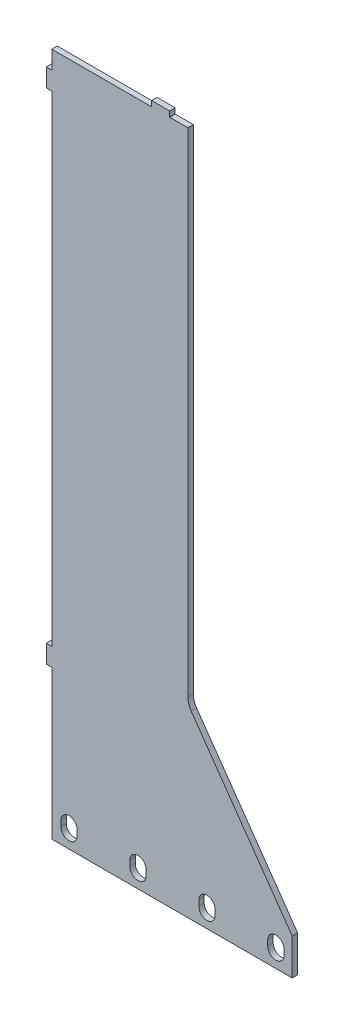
ISO-10303-21;
HEADER;
FILE_DESCRIPTION(('STEP AP214'),'2;1');
FILE_NAME('part.step','',(''),(''),'','','');
FILE_SCHEMA(('AUTOMOTIVE_DESIGN { 1 0 10303 214 1 1 1 1 }'));
ENDSEC;
DATA;
#1=APPLICATION_CONTEXT('core data for automotive mechanical design processes');
#2=APPLICATION_PROTOCOL_DEFINITION('international standard','automotive_design',2000,#1);
#3=PRODUCT_CONTEXT('',#1,'mechanical');
#4=PRODUCT('Part','Part','',(#3));
#5=PRODUCT_RELATED_PRODUCT_CATEGORY('part','',(#4));
#6=PRODUCT_DEFINITION_FORMATION('','',#4);
#7=PRODUCT_DEFINITION_CONTEXT('part definition',#1,'design');
#8=PRODUCT_DEFINITION('design','',#6,#7);
#9=PRODUCT_DEFINITION_SHAPE('','',#8);
#10=(LENGTH_UNIT() NAMED_UNIT(*) SI_UNIT(.MILLI.,.METRE.));
#11=(NAMED_UNIT(*) PLANE_ANGLE_UNIT() SI_UNIT($,.RADIAN.));
#12=(NAMED_UNIT(*) SI_UNIT($,.STERADIAN.) SOLID_ANGLE_UNIT());
#13=UNCERTAINTY_MEASURE_WITH_UNIT(LENGTH_MEASURE(1.E-05),#10,'distance_accuracy_value','');
#14=(GEOMETRIC_REPRESENTATION_CONTEXT(3) GLOBAL_UNCERTAINTY_ASSIGNED_CONTEXT((#13)) GLOBAL_UNIT_ASSIGNED_CONTEXT((#10,
#11,#12)) REPRESENTATION_CONTEXT('',''));
#15=CARTESIAN_POINT('',(0.,0.,0.));
#16=DIRECTION('',(0.,0.,1.));
#17=DIRECTION('',(1.,0.,0.));
#18=AXIS2_PLACEMENT_3D('',#15,#16,#17);
#19=CARTESIAN_POINT('',(0.,313.,93.));
#20=DIRECTION('',(0.,1.,0.));
#21=DIRECTION('',(0.,0.,1.));
#22=AXIS2_PLACEMENT_3D('',#19,#20,#21);
#23=PLANE('',#22);
#24=DIRECTION('',(-1.,0.,0.));
#25=VECTOR('',#24,1.);
#26=CARTESIAN_POINT('',(0.,313.,93.));
#27=LINE('',#26,#25);
#28=CARTESIAN_POINT('',(75.,313.,93.));
#29=VERTEX_POINT('',#28);
#30=CARTESIAN_POINT('',(65.,313.,92.9999999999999));
#31=VERTEX_POINT('',#30);
#32=EDGE_CURVE('E269',#29,#31,#27,.T.);
#33=ORIENTED_EDGE('',*,*,#32,.T.);
#34=DIRECTION('',(0.,0.,1.));
#35=VECTOR('',#34,1.);
#36=CARTESIAN_POINT('',(65.,313.,82.5596934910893));
#37=LINE('',#36,#35);
#38=CARTESIAN_POINT('',(65.,313.,96.));
#39=VERTEX_POINT('',#38);
#40=EDGE_CURVE('E274',#31,#39,#37,.T.);
#41=ORIENTED_EDGE('',*,*,#40,.T.);
#42=DIRECTION('',(-1.,0.,0.));
#43=VECTOR('',#42,1.);
#44=CARTESIAN_POINT('',(0.,313.,96.));
#45=LINE('',#44,#43);
#46=CARTESIAN_POINT('',(75.,313.,96.));
#47=VERTEX_POINT('',#46);
#48=EDGE_CURVE('E316',#47,#39,#45,.T.);
#49=ORIENTED_EDGE('',*,*,#48,.F.);
#50=DIRECTION('',(0.,0.,1.));
#51=VECTOR('',#50,1.);
#52=CARTESIAN_POINT('',(75.,313.,92.9999999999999));
#53=LINE('',#52,#51);
#54=EDGE_CURVE('E283',#29,#47,#53,.T.);
#55=ORIENTED_EDGE('',*,*,#54,.F.);
#56=EDGE_LOOP('',(#33,#41,#49,#55));
#57=FACE_BOUND('',#56,.T.);
#58=ADVANCED_FACE('F37',(#57),#23,.T.);
#59=CARTESIAN_POINT('',(132.5,0.,3.));
#60=DIRECTION('',(-1.,0.,0.));
#61=DIRECTION('',(0.,0.,1.));
#62=AXIS2_PLACEMENT_3D('',#59,#60,#61);
#63=PLANE('',#62);
#64=DIRECTION('',(0.,1.,0.));
#65=VECTOR('',#64,1.);
#66=CARTESIAN_POINT('',(132.5,0.,93.));
#67=LINE('',#66,#65);
#68=CARTESIAN_POINT('',(132.5,-64.,93.));
#69=VERTEX_POINT('',#68);
#70=CARTESIAN_POINT('',(132.5,-44.,92.9999999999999));
#71=VERTEX_POINT('',#70);
#72=EDGE_CURVE('E462',#69,#71,#67,.T.);
#73=ORIENTED_EDGE('',*,*,#72,.T.);
#74=DIRECTION('',(0.,0.,1.));
#75=VECTOR('',#74,1.);
#76=CARTESIAN_POINT('',(132.5,-44.,92.9999999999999));
#77=LINE('',#76,#75);
#78=CARTESIAN_POINT('',(132.5,-44.,96.));
#79=VERTEX_POINT('',#78);
#80=EDGE_CURVE('E292',#71,#79,#77,.T.);
#81=ORIENTED_EDGE('',*,*,#80,.T.);
#82=DIRECTION('',(0.,-1.,0.));
#83=VECTOR('',#82,1.);
#84=CARTESIAN_POINT('',(132.5,0.,96.));
#85=LINE('',#84,#83);
#86=CARTESIAN_POINT('',(132.5,-64.,96.));
#87=VERTEX_POINT('',#86);
#88=EDGE_CURVE('E478',#79,#87,#85,.T.);
#89=ORIENTED_EDGE('',*,*,#88,.T.);
#90=DIRECTION('',(0.,0.,-1.));
#91=VECTOR('',#90,1.);
#92=CARTESIAN_POINT('',(132.5,-64.,93.));
#93=LINE('',#92,#91);
#94=EDGE_CURVE('E465',#87,#69,#93,.T.);
#95=ORIENTED_EDGE('',*,*,#94,.T.);
#96=EDGE_LOOP('',(#73,#81,#89,#95));
#97=FACE_BOUND('',#96,.T.);
#98=ADVANCED_FACE('F578',(#97),#63,.F.);
#99=CARTESIAN_POINT('',(0.,0.,3.));
#100=DIRECTION('',(1.,0.,0.));
#101=DIRECTION('',(0.,0.,-1.));
#102=AXIS2_PLACEMENT_3D('',#99,#100,#101);
#103=PLANE('',#102);
#104=DIRECTION('',(0.,0.,1.));
#105=VECTOR('',#104,1.);
#106=CARTESIAN_POINT('',(0.,18.,93.));
#107=LINE('',#106,#105);
#108=CARTESIAN_POINT('',(0.,18.,93.));
#109=VERTEX_POINT('',#108);
#110=CARTESIAN_POINT('',(0.,18.,96.));
#111=VERTEX_POINT('',#110);
#112=EDGE_CURVE('E342',#109,#111,#107,.T.);
#113=ORIENTED_EDGE('',*,*,#112,.F.);
#114=DIRECTION('',(0.,-1.,0.));
#115=VECTOR('',#114,1.);
#116=CARTESIAN_POINT('',(0.,0.,93.));
#117=LINE('',#116,#115);
#118=CARTESIAN_POINT('',(0.,-64.,93.));
#119=VERTEX_POINT('',#118);
#120=EDGE_CURVE('E461',#109,#119,#117,.T.);
#121=ORIENTED_EDGE('',*,*,#120,.T.);
#122=DIRECTION('',(0.,0.,1.));
#123=VECTOR('',#122,1.);
#124=CARTESIAN_POINT('',(0.,-64.,93.));
#125=LINE('',#124,#123);
#126=CARTESIAN_POINT('',(0.,-64.,96.));
#127=VERTEX_POINT('',#126);
#128=EDGE_CURVE('E468',#119,#127,#125,.T.);
#129=ORIENTED_EDGE('',*,*,#128,.T.);
#130=DIRECTION('',(0.,1.,0.));
#131=VECTOR('',#130,1.);
#132=CARTESIAN_POINT('',(0.,0.,96.));
#133=LINE('',#132,#131);
#134=EDGE_CURVE('E477',#127,#111,#133,.T.);
#135=ORIENTED_EDGE('',*,*,#134,.T.);
#136=EDGE_LOOP('',(#113,#121,#129,#135));
#137=FACE_BOUND('',#136,.T.);
#138=ADVANCED_FACE('F576',(#137),#103,.F.);
#139=CARTESIAN_POINT('',(225.548374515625,0.,96.));
#140=DIRECTION('',(0.,0.,1.));
#141=DIRECTION('',(1.,0.,0.));
#142=AXIS2_PLACEMENT_3D('',#139,#140,#141);
#143=PLANE('',#142);
#144=DIRECTION('',(0.,-1.,0.));
#145=VECTOR('',#144,1.);
#146=CARTESIAN_POINT('',(75.,313.,96.));
#147=LINE('',#146,#145);
#148=CARTESIAN_POINT('',(75.,41.2714982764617,96.));
#149=VERTEX_POINT('',#148);
#150=EDGE_CURVE('E505',#47,#149,#147,.T.);
#151=ORIENTED_EDGE('',*,*,#150,.F.);
#152=ORIENTED_EDGE('',*,*,#48,.T.);
#153=DIRECTION('',(0.,1.,0.));
#154=VECTOR('',#153,1.);
#155=CARTESIAN_POINT('',(65.,313.,96.));
#156=LINE('',#155,#154);
#157=CARTESIAN_POINT('',(65.,316.,96.));
#158=VERTEX_POINT('',#157);
#159=EDGE_CURVE('E52',#39,#158,#156,.T.);
#160=ORIENTED_EDGE('',*,*,#159,.T.);
#161=DIRECTION('',(-1.,0.,0.));
#162=VECTOR('',#161,1.);
#163=CARTESIAN_POINT('',(55.,316.,96.));
#164=LINE('',#163,#162);
#165=CARTESIAN_POINT('',(55.,316.,96.));
#166=VERTEX_POINT('',#165);
#167=EDGE_CURVE('E280',#158,#166,#164,.T.);
#168=ORIENTED_EDGE('',*,*,#167,.T.);
#169=DIRECTION('',(0.,-1.,0.));
#170=VECTOR('',#169,1.);
#171=CARTESIAN_POINT('',(55.,313.,96.));
#172=LINE('',#171,#170);
#173=CARTESIAN_POINT('',(55.,313.,96.));
#174=VERTEX_POINT('',#173);
#175=EDGE_CURVE('E531',#166,#174,#172,.T.);
#176=ORIENTED_EDGE('',*,*,#175,.T.);
#177=CARTESIAN_POINT('',(0.,313.,96.));
#178=VERTEX_POINT('',#177);
#179=EDGE_CURVE('E319',#174,#178,#45,.T.);
#180=ORIENTED_EDGE('',*,*,#179,.T.);
#181=DIRECTION('',(0.,-1.,0.));
#182=VECTOR('',#181,1.);
#183=CARTESIAN_POINT('',(0.,303.,96.));
#184=LINE('',#183,#182);
#185=CARTESIAN_POINT('',(0.,303.,96.));
#186=VERTEX_POINT('',#185);
#187=EDGE_CURVE('E318',#178,#186,#184,.T.);
#188=ORIENTED_EDGE('',*,*,#187,.T.);
#189=DIRECTION('',(-1.,0.,0.));
#190=VECTOR('',#189,1.);
#191=CARTESIAN_POINT('',(0.,303.,96.));
#192=LINE('',#191,#190);
#193=CARTESIAN_POINT('',(-3.,303.,96.));
#194=VERTEX_POINT('',#193);
#195=EDGE_CURVE('E322',#186,#194,#192,.T.);
#196=ORIENTED_EDGE('',*,*,#195,.T.);
#197=DIRECTION('',(0.,-1.,0.));
#198=VECTOR('',#197,1.);
#199=CARTESIAN_POINT('',(-3.,303.,96.));
#200=LINE('',#199,#198);
#201=CARTESIAN_POINT('',(-3.,293.,96.));
#202=VERTEX_POINT('',#201);
#203=EDGE_CURVE('E325',#194,#202,#200,.T.);
#204=ORIENTED_EDGE('',*,*,#203,.T.);
#205=DIRECTION('',(1.,0.,0.));
#206=VECTOR('',#205,1.);
#207=CARTESIAN_POINT('',(-3.,293.,96.));
#208=LINE('',#207,#206);
#209=CARTESIAN_POINT('',(0.,293.,96.));
#210=VERTEX_POINT('',#209);
#211=EDGE_CURVE('E328',#202,#210,#208,.T.);
#212=ORIENTED_EDGE('',*,*,#211,.T.);
#213=DIRECTION('',(0.,-1.,0.));
#214=VECTOR('',#213,1.);
#215=CARTESIAN_POINT('',(0.,28.,96.));
#216=LINE('',#215,#214);
#217=CARTESIAN_POINT('',(0.,28.,96.));
#218=VERTEX_POINT('',#217);
#219=EDGE_CURVE('E331',#210,#218,#216,.T.);
#220=ORIENTED_EDGE('',*,*,#219,.T.);
#221=DIRECTION('',(-1.,0.,0.));
#222=VECTOR('',#221,1.);
#223=CARTESIAN_POINT('',(0.,28.,96.));
#224=LINE('',#223,#222);
#225=CARTESIAN_POINT('',(-3.00000000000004,28.,96.));
#226=VERTEX_POINT('',#225);
#227=EDGE_CURVE('E334',#218,#226,#224,.T.);
#228=ORIENTED_EDGE('',*,*,#227,.T.);
#229=DIRECTION('',(0.,-1.,0.));
#230=VECTOR('',#229,1.);
#231=CARTESIAN_POINT('',(-3.00000000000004,28.,96.));
#232=LINE('',#231,#230);
#233=CARTESIAN_POINT('',(-3.00000000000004,18.,96.));
#234=VERTEX_POINT('',#233);
#235=EDGE_CURVE('E337',#226,#234,#232,.T.);
#236=ORIENTED_EDGE('',*,*,#235,.T.);
#237=DIRECTION('',(1.,0.,0.));
#238=VECTOR('',#237,1.);
#239=CARTESIAN_POINT('',(-3.00000000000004,18.,96.));
#240=LINE('',#239,#238);
#241=EDGE_CURVE('E290',#234,#111,#240,.T.);
#242=ORIENTED_EDGE('',*,*,#241,.T.);
#243=ORIENTED_EDGE('',*,*,#134,.F.);
#244=DIRECTION('',(-1.,0.,0.));
#245=VECTOR('',#244,1.);
#246=CARTESIAN_POINT('',(196.570273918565,-64.,96.));
#247=LINE('',#246,#245);
#248=EDGE_CURVE('E466',#87,#127,#247,.T.);
#249=ORIENTED_EDGE('',*,*,#248,.F.);
#250=ORIENTED_EDGE('',*,*,#88,.F.);
#251=DIRECTION('',(0.573576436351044,-0.819152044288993,0.));
#252=VECTOR('',#251,1.);
#253=CARTESIAN_POINT('',(75.,38.1185103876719,96.));
#254=LINE('',#253,#252);
#255=CARTESIAN_POINT('',(76.8084795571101,35.5357339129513,96.));
#256=VERTEX_POINT('',#255);
#257=EDGE_CURVE('E507',#256,#79,#254,.T.);
#258=ORIENTED_EDGE('',*,*,#257,.F.);
#259=CARTESIAN_POINT('',(85.,41.2714982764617,96.));
#260=DIRECTION('',(0.,0.,1.));
#261=DIRECTION('',(1.,0.,0.));
#262=AXIS2_PLACEMENT_3D('',#259,#260,#261);
#263=CIRCLE('',#262,10.);
#264=EDGE_CURVE('E45',#256,#149,#263,.F.);
#265=ORIENTED_EDGE('',*,*,#264,.T.);
#266=EDGE_LOOP('',(#151,#152,#160,#168,#176,#180,#188,#196,#204,#212,#220,#228,#236,#242,#243,
#249,#250,#258,#265));
#267=FACE_BOUND('',#266,.T.);
#268=CARTESIAN_POINT('',(85.5,-52.5,96.));
#269=DIRECTION('',(0.,0.,1.));
#270=DIRECTION('',(1.,0.,0.));
#271=AXIS2_PLACEMENT_3D('',#268,#269,#270);
#272=CIRCLE('',#271,4.5);
#273=CARTESIAN_POINT('',(90.,-52.5,96.));
#274=VERTEX_POINT('',#273);
#275=CARTESIAN_POINT('',(81.,-52.5,96.));
#276=VERTEX_POINT('',#275);
#277=EDGE_CURVE('E362',#274,#276,#272,.T.);
#278=ORIENTED_EDGE('',*,*,#277,.F.);
#279=DIRECTION('',(0.,1.,0.));
#280=VECTOR('',#279,1.);
#281=CARTESIAN_POINT('',(90.,-52.5,96.));
#282=LINE('',#281,#280);
#283=CARTESIAN_POINT('',(90.,-55.5,96.));
#284=VERTEX_POINT('',#283);
#285=EDGE_CURVE('E372',#284,#274,#282,.T.);
#286=ORIENTED_EDGE('',*,*,#285,.F.);
#287=CARTESIAN_POINT('',(85.5,-55.5,96.));
#288=DIRECTION('',(0.,0.,1.));
#289=DIRECTION('',(1.,0.,0.));
#290=AXIS2_PLACEMENT_3D('',#287,#288,#289);
#291=CIRCLE('',#290,4.5);
#292=CARTESIAN_POINT('',(81.,-55.5,96.));
#293=VERTEX_POINT('',#292);
#294=EDGE_CURVE('E369',#293,#284,#291,.T.);
#295=ORIENTED_EDGE('',*,*,#294,.F.);
#296=DIRECTION('',(0.,-1.,0.));
#297=VECTOR('',#296,1.);
#298=CARTESIAN_POINT('',(81.,-52.5,96.));
#299=LINE('',#298,#297);
#300=EDGE_CURVE('E365',#276,#293,#299,.T.);
#301=ORIENTED_EDGE('',*,*,#300,.F.);
#302=EDGE_LOOP('',(#278,#286,#295,#301));
#303=FACE_BOUND('',#302,.T.);
#304=CARTESIAN_POINT('',(123.5,-52.5,96.));
#305=DIRECTION('',(0.,0.,1.));
#306=DIRECTION('',(1.,0.,0.));
#307=AXIS2_PLACEMENT_3D('',#304,#305,#306);
#308=CIRCLE('',#307,4.5);
#309=CARTESIAN_POINT('',(128.,-52.5,96.));
#310=VERTEX_POINT('',#309);
#311=CARTESIAN_POINT('',(119.,-52.5,96.));
#312=VERTEX_POINT('',#311);
#313=EDGE_CURVE('E345',#310,#312,#308,.T.);
#314=ORIENTED_EDGE('',*,*,#313,.F.);
#315=DIRECTION('',(0.,1.,0.));
#316=VECTOR('',#315,1.);
#317=CARTESIAN_POINT('',(128.,-52.5,96.));
#318=LINE('',#317,#316);
#319=CARTESIAN_POINT('',(128.,-55.5,96.));
#320=VERTEX_POINT('',#319);
#321=EDGE_CURVE('E393',#320,#310,#318,.T.);
#322=ORIENTED_EDGE('',*,*,#321,.F.);
#323=CARTESIAN_POINT('',(123.5,-55.5,96.));
#324=DIRECTION('',(0.,0.,1.));
#325=DIRECTION('',(1.,0.,0.));
#326=AXIS2_PLACEMENT_3D('',#323,#324,#325);
#327=CIRCLE('',#326,4.5);
#328=CARTESIAN_POINT('',(119.,-55.5,96.));
#329=VERTEX_POINT('',#328);
#330=EDGE_CURVE('E390',#329,#320,#327,.T.);
#331=ORIENTED_EDGE('',*,*,#330,.F.);
#332=DIRECTION('',(0.,-1.,0.));
#333=VECTOR('',#332,1.);
#334=CARTESIAN_POINT('',(119.,-52.5,96.));
#335=LINE('',#334,#333);
#336=EDGE_CURVE('E387',#312,#329,#335,.T.);
#337=ORIENTED_EDGE('',*,*,#336,.F.);
#338=EDGE_LOOP('',(#314,#322,#331,#337));
#339=FACE_BOUND('',#338,.T.);
#340=CARTESIAN_POINT('',(47.5,-52.5,96.));
#341=DIRECTION('',(0.,0.,1.));
#342=DIRECTION('',(1.,0.,0.));
#343=AXIS2_PLACEMENT_3D('',#340,#341,#342);
#344=CIRCLE('',#343,4.5);
#345=CARTESIAN_POINT('',(52.,-52.5,96.));
#346=VERTEX_POINT('',#345);
#347=CARTESIAN_POINT('',(43.,-52.5,96.));
#348=VERTEX_POINT('',#347);
#349=EDGE_CURVE('E411',#346,#348,#344,.T.);
#350=ORIENTED_EDGE('',*,*,#349,.F.);
#351=DIRECTION('',(0.,1.,0.));
#352=VECTOR('',#351,1.);
#353=CARTESIAN_POINT('',(52.,-52.5,96.));
#354=LINE('',#353,#352);
#355=CARTESIAN_POINT('',(52.,-55.5,96.));
#356=VERTEX_POINT('',#355);
#357=EDGE_CURVE('E420',#356,#346,#354,.T.);
#358=ORIENTED_EDGE('',*,*,#357,.F.);
#359=CARTESIAN_POINT('',(47.5,-55.5,96.));
#360=DIRECTION('',(0.,0.,1.));
#361=DIRECTION('',(1.,0.,0.));
#362=AXIS2_PLACEMENT_3D('',#359,#360,#361);
#363=CIRCLE('',#362,4.5);
#364=CARTESIAN_POINT('',(43.,-55.5,96.));
#365=VERTEX_POINT('',#364);
#366=EDGE_CURVE('E417',#365,#356,#363,.T.);
#367=ORIENTED_EDGE('',*,*,#366,.F.);
#368=DIRECTION('',(0.,-1.,0.));
#369=VECTOR('',#368,1.);
#370=CARTESIAN_POINT('',(43.,-52.5,96.));
#371=LINE('',#370,#369);
#372=EDGE_CURVE('E414',#348,#365,#371,.T.);
#373=ORIENTED_EDGE('',*,*,#372,.F.);
#374=EDGE_LOOP('',(#350,#358,#367,#373));
#375=FACE_BOUND('',#374,.T.);
#376=CARTESIAN_POINT('',(9.50000000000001,-52.5,96.));
#377=DIRECTION('',(0.,0.,1.));
#378=DIRECTION('',(1.,0.,0.));
#379=AXIS2_PLACEMENT_3D('',#376,#377,#378);
#380=CIRCLE('',#379,4.5);
#381=CARTESIAN_POINT('',(14.,-52.5,96.));
#382=VERTEX_POINT('',#381);
#383=CARTESIAN_POINT('',(5.,-52.5,96.));
#384=VERTEX_POINT('',#383);
#385=EDGE_CURVE('E436',#382,#384,#380,.T.);
#386=ORIENTED_EDGE('',*,*,#385,.F.);
#387=DIRECTION('',(0.,1.,0.));
#388=VECTOR('',#387,1.);
#389=CARTESIAN_POINT('',(14.,-52.5,96.));
#390=LINE('',#389,#388);
#391=CARTESIAN_POINT('',(14.,-55.5,96.));
#392=VERTEX_POINT('',#391);
#393=EDGE_CURVE('E445',#392,#382,#390,.T.);
#394=ORIENTED_EDGE('',*,*,#393,.F.);
#395=CARTESIAN_POINT('',(9.50000000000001,-55.5,96.));
#396=DIRECTION('',(0.,0.,1.));
#397=DIRECTION('',(1.,0.,0.));
#398=AXIS2_PLACEMENT_3D('',#395,#396,#397);
#399=CIRCLE('',#398,4.5);
#400=CARTESIAN_POINT('',(5.,-55.5,96.));
#401=VERTEX_POINT('',#400);
#402=EDGE_CURVE('E442',#401,#392,#399,.T.);
#403=ORIENTED_EDGE('',*,*,#402,.F.);
#404=DIRECTION('',(0.,-1.,0.));
#405=VECTOR('',#404,1.);
#406=CARTESIAN_POINT('',(5.,-52.5,96.));
#407=LINE('',#406,#405);
#408=EDGE_CURVE('E439',#384,#401,#407,.T.);
#409=ORIENTED_EDGE('',*,*,#408,.F.);
#410=EDGE_LOOP('',(#386,#394,#403,#409));
#411=FACE_BOUND('',#410,.T.);
#412=ADVANCED_FACE('F503',(#267,#303,#339,#375,#411),#143,.T.);
#413=CARTESIAN_POINT('',(196.570273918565,0.,93.));
#414=DIRECTION('',(0.,0.,-1.));
#415=DIRECTION('',(0.,1.,0.));
#416=AXIS2_PLACEMENT_3D('',#413,#414,#415);
#417=PLANE('',#416);
#418=DIRECTION('',(0.,-1.,0.));
#419=VECTOR('',#418,1.);
#420=CARTESIAN_POINT('',(75.,313.,92.9999999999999));
#421=LINE('',#420,#419);
#422=CARTESIAN_POINT('',(75.,41.2714982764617,92.9999999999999));
#423=VERTEX_POINT('',#422);
#424=EDGE_CURVE('E518',#29,#423,#421,.T.);
#425=ORIENTED_EDGE('',*,*,#424,.T.);
#426=CARTESIAN_POINT('',(85.,41.2714982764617,93.));
#427=DIRECTION('',(0.,0.,-1.));
#428=DIRECTION('',(0.,1.,0.));
#429=AXIS2_PLACEMENT_3D('',#426,#427,#428);
#430=CIRCLE('',#429,10.);
#431=CARTESIAN_POINT('',(76.8084795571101,35.5357339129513,92.9999999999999));
#432=VERTEX_POINT('',#431);
#433=EDGE_CURVE('E11',#423,#432,#430,.F.);
#434=ORIENTED_EDGE('',*,*,#433,.T.);
#435=DIRECTION('',(0.573576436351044,-0.819152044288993,0.));
#436=VECTOR('',#435,1.);
#437=CARTESIAN_POINT('',(75.,38.1185103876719,92.9999999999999));
#438=LINE('',#437,#436);
#439=EDGE_CURVE('E516',#432,#71,#438,.T.);
#440=ORIENTED_EDGE('',*,*,#439,.T.);
#441=ORIENTED_EDGE('',*,*,#72,.F.);
#442=DIRECTION('',(-1.,0.,0.));
#443=VECTOR('',#442,1.);
#444=CARTESIAN_POINT('',(196.570273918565,-64.,93.));
#445=LINE('',#444,#443);
#446=EDGE_CURVE('E471',#69,#119,#445,.T.);
#447=ORIENTED_EDGE('',*,*,#446,.T.);
#448=ORIENTED_EDGE('',*,*,#120,.F.);
#449=DIRECTION('',(1.,0.,0.));
#450=VECTOR('',#449,1.);
#451=CARTESIAN_POINT('',(-3.00000000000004,18.,93.));
#452=LINE('',#451,#450);
#453=CARTESIAN_POINT('',(-3.00000000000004,18.,93.));
#454=VERTEX_POINT('',#453);
#455=EDGE_CURVE('E312',#454,#109,#452,.T.);
#456=ORIENTED_EDGE('',*,*,#455,.F.);
#457=DIRECTION('',(0.,-1.,0.));
#458=VECTOR('',#457,1.);
#459=CARTESIAN_POINT('',(-3.00000000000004,28.,93.));
#460=LINE('',#459,#458);
#461=CARTESIAN_POINT('',(-3.00000000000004,28.,93.));
#462=VERTEX_POINT('',#461);
#463=EDGE_CURVE('E309',#462,#454,#460,.T.);
#464=ORIENTED_EDGE('',*,*,#463,.F.);
#465=DIRECTION('',(-1.,0.,0.));
#466=VECTOR('',#465,1.);
#467=CARTESIAN_POINT('',(0.,28.,93.));
#468=LINE('',#467,#466);
#469=CARTESIAN_POINT('',(0.,28.,93.));
#470=VERTEX_POINT('',#469);
#471=EDGE_CURVE('E306',#470,#462,#468,.T.);
#472=ORIENTED_EDGE('',*,*,#471,.F.);
#473=DIRECTION('',(0.,-1.,0.));
#474=VECTOR('',#473,1.);
#475=CARTESIAN_POINT('',(0.,28.,93.));
#476=LINE('',#475,#474);
#477=CARTESIAN_POINT('',(0.,293.,93.));
#478=VERTEX_POINT('',#477);
#479=EDGE_CURVE('E303',#478,#470,#476,.T.);
#480=ORIENTED_EDGE('',*,*,#479,.F.);
#481=DIRECTION('',(1.,0.,0.));
#482=VECTOR('',#481,1.);
#483=CARTESIAN_POINT('',(-3.,293.,93.));
#484=LINE('',#483,#482);
#485=CARTESIAN_POINT('',(-3.,293.,93.));
#486=VERTEX_POINT('',#485);
#487=EDGE_CURVE('E300',#486,#478,#484,.T.);
#488=ORIENTED_EDGE('',*,*,#487,.F.);
#489=DIRECTION('',(0.,-1.,0.));
#490=VECTOR('',#489,1.);
#491=CARTESIAN_POINT('',(-3.,303.,93.));
#492=LINE('',#491,#490);
#493=CARTESIAN_POINT('',(-3.,303.,93.));
#494=VERTEX_POINT('',#493);
#495=EDGE_CURVE('E297',#494,#486,#492,.T.);
#496=ORIENTED_EDGE('',*,*,#495,.F.);
#497=DIRECTION('',(-1.,0.,0.));
#498=VECTOR('',#497,1.);
#499=CARTESIAN_POINT('',(0.,303.,93.));
#500=LINE('',#499,#498);
#501=CARTESIAN_POINT('',(0.,303.,93.));
#502=VERTEX_POINT('',#501);
#503=EDGE_CURVE('E288',#502,#494,#500,.T.);
#504=ORIENTED_EDGE('',*,*,#503,.F.);
#505=DIRECTION('',(0.,-1.,0.));
#506=VECTOR('',#505,1.);
#507=CARTESIAN_POINT('',(0.,303.,93.));
#508=LINE('',#507,#506);
#509=CARTESIAN_POINT('',(0.,313.,93.));
#510=VERTEX_POINT('',#509);
#511=EDGE_CURVE('E284',#510,#502,#508,.T.);
#512=ORIENTED_EDGE('',*,*,#511,.F.);
#513=CARTESIAN_POINT('',(55.,313.,92.9999999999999));
#514=VERTEX_POINT('',#513);
#515=EDGE_CURVE('E285',#514,#510,#27,.T.);
#516=ORIENTED_EDGE('',*,*,#515,.F.);
#517=DIRECTION('',(0.,-1.,0.));
#518=VECTOR('',#517,1.);
#519=CARTESIAN_POINT('',(55.,313.,92.9999999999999));
#520=LINE('',#519,#518);
#521=CARTESIAN_POINT('',(55.,316.,92.9999999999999));
#522=VERTEX_POINT('',#521);
#523=EDGE_CURVE('E691',#522,#514,#520,.T.);
#524=ORIENTED_EDGE('',*,*,#523,.F.);
#525=DIRECTION('',(-1.,0.,0.));
#526=VECTOR('',#525,1.);
#527=CARTESIAN_POINT('',(55.,316.,92.9999999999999));
#528=LINE('',#527,#526);
#529=CARTESIAN_POINT('',(65.,316.,92.9999999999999));
#530=VERTEX_POINT('',#529);
#531=EDGE_CURVE('E271',#530,#522,#528,.T.);
#532=ORIENTED_EDGE('',*,*,#531,.F.);
#533=DIRECTION('',(0.,1.,0.));
#534=VECTOR('',#533,1.);
#535=CARTESIAN_POINT('',(65.,313.,92.9999999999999));
#536=LINE('',#535,#534);
#537=EDGE_CURVE('E265',#31,#530,#536,.T.);
#538=ORIENTED_EDGE('',*,*,#537,.F.);
#539=ORIENTED_EDGE('',*,*,#32,.F.);
#540=EDGE_LOOP('',(#425,#434,#440,#441,#447,#448,#456,#464,#472,#480,#488,#496,#504,#512,#516,
#524,#532,#538,#539));
#541=FACE_BOUND('',#540,.T.);
#542=CARTESIAN_POINT('',(85.5,-52.5,93.));
#543=DIRECTION('',(0.,0.,-1.));
#544=DIRECTION('',(0.,1.,0.));
#545=AXIS2_PLACEMENT_3D('',#542,#543,#544);
#546=CIRCLE('',#545,4.5);
#547=CARTESIAN_POINT('',(81.,-52.5,93.));
#548=VERTEX_POINT('',#547);
#549=CARTESIAN_POINT('',(90.,-52.5,93.));
#550=VERTEX_POINT('',#549);
#551=EDGE_CURVE('E495',#548,#550,#546,.T.);
#552=ORIENTED_EDGE('',*,*,#551,.F.);
#553=DIRECTION('',(0.,1.,0.));
#554=VECTOR('',#553,1.);
#555=CARTESIAN_POINT('',(81.,0.,93.));
#556=LINE('',#555,#554);
#557=CARTESIAN_POINT('',(81.,-55.5,93.));
#558=VERTEX_POINT('',#557);
#559=EDGE_CURVE('E407',#558,#548,#556,.T.);
#560=ORIENTED_EDGE('',*,*,#559,.F.);
#561=CARTESIAN_POINT('',(85.5,-55.5,93.));
#562=DIRECTION('',(0.,0.,-1.));
#563=DIRECTION('',(0.,1.,0.));
#564=AXIS2_PLACEMENT_3D('',#561,#562,#563);
#565=CIRCLE('',#564,4.5);
#566=CARTESIAN_POINT('',(90.,-55.5,93.));
#567=VERTEX_POINT('',#566);
#568=EDGE_CURVE('E493',#567,#558,#565,.T.);
#569=ORIENTED_EDGE('',*,*,#568,.F.);
#570=DIRECTION('',(0.,-1.,0.));
#571=VECTOR('',#570,1.);
#572=CARTESIAN_POINT('',(90.,0.,93.));
#573=LINE('',#572,#571);
#574=EDGE_CURVE('E409',#550,#567,#573,.T.);
#575=ORIENTED_EDGE('',*,*,#574,.F.);
#576=EDGE_LOOP('',(#552,#560,#569,#575));
#577=FACE_BOUND('',#576,.T.);
#578=CARTESIAN_POINT('',(123.5,-52.5,93.));
#579=DIRECTION('',(0.,0.,-1.));
#580=DIRECTION('',(0.,1.,0.));
#581=AXIS2_PLACEMENT_3D('',#578,#579,#580);
#582=CIRCLE('',#581,4.5);
#583=CARTESIAN_POINT('',(119.,-52.5,93.));
#584=VERTEX_POINT('',#583);
#585=CARTESIAN_POINT('',(128.,-52.5,93.));
#586=VERTEX_POINT('',#585);
#587=EDGE_CURVE('E491',#584,#586,#582,.T.);
#588=ORIENTED_EDGE('',*,*,#587,.F.);
#589=DIRECTION('',(0.,1.,0.));
#590=VECTOR('',#589,1.);
#591=CARTESIAN_POINT('',(119.,0.,93.));
#592=LINE('',#591,#590);
#593=CARTESIAN_POINT('',(119.,-55.5,93.));
#594=VERTEX_POINT('',#593);
#595=EDGE_CURVE('E378',#594,#584,#592,.T.);
#596=ORIENTED_EDGE('',*,*,#595,.F.);
#597=CARTESIAN_POINT('',(123.5,-55.5,93.));
#598=DIRECTION('',(0.,0.,-1.));
#599=DIRECTION('',(0.,1.,0.));
#600=AXIS2_PLACEMENT_3D('',#597,#598,#599);
#601=CIRCLE('',#600,4.5);
#602=CARTESIAN_POINT('',(128.,-55.5,93.));
#603=VERTEX_POINT('',#602);
#604=EDGE_CURVE('E489',#603,#594,#601,.T.);
#605=ORIENTED_EDGE('',*,*,#604,.F.);
#606=DIRECTION('',(0.,-1.,0.));
#607=VECTOR('',#606,1.);
#608=CARTESIAN_POINT('',(128.,0.,93.));
#609=LINE('',#608,#607);
#610=EDGE_CURVE('E405',#586,#603,#609,.T.);
#611=ORIENTED_EDGE('',*,*,#610,.F.);
#612=EDGE_LOOP('',(#588,#596,#605,#611));
#613=FACE_BOUND('',#612,.T.);
#614=CARTESIAN_POINT('',(47.5,-52.5,93.));
#615=DIRECTION('',(0.,0.,-1.));
#616=DIRECTION('',(0.,1.,0.));
#617=AXIS2_PLACEMENT_3D('',#614,#615,#616);
#618=CIRCLE('',#617,4.5);
#619=CARTESIAN_POINT('',(43.,-52.5,93.));
#620=VERTEX_POINT('',#619);
#621=CARTESIAN_POINT('',(52.,-52.5,93.));
#622=VERTEX_POINT('',#621);
#623=EDGE_CURVE('E487',#620,#622,#618,.T.);
#624=ORIENTED_EDGE('',*,*,#623,.F.);
#625=DIRECTION('',(0.,1.,0.));
#626=VECTOR('',#625,1.);
#627=CARTESIAN_POINT('',(43.,0.,93.));
#628=LINE('',#627,#626);
#629=CARTESIAN_POINT('',(43.,-55.5,93.));
#630=VERTEX_POINT('',#629);
#631=EDGE_CURVE('E426',#630,#620,#628,.T.);
#632=ORIENTED_EDGE('',*,*,#631,.F.);
#633=CARTESIAN_POINT('',(47.5,-55.5,93.));
#634=DIRECTION('',(0.,0.,-1.));
#635=DIRECTION('',(0.,1.,0.));
#636=AXIS2_PLACEMENT_3D('',#633,#634,#635);
#637=CIRCLE('',#636,4.5);
#638=CARTESIAN_POINT('',(52.,-55.5,93.));
#639=VERTEX_POINT('',#638);
#640=EDGE_CURVE('E485',#639,#630,#637,.T.);
#641=ORIENTED_EDGE('',*,*,#640,.F.);
#642=DIRECTION('',(0.,-1.,0.));
#643=VECTOR('',#642,1.);
#644=CARTESIAN_POINT('',(52.,0.,93.));
#645=LINE('',#644,#643);
#646=EDGE_CURVE('E434',#622,#639,#645,.T.);
#647=ORIENTED_EDGE('',*,*,#646,.F.);
#648=EDGE_LOOP('',(#624,#632,#641,#647));
#649=FACE_BOUND('',#648,.T.);
#650=CARTESIAN_POINT('',(9.50000000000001,-52.5,93.));
#651=DIRECTION('',(0.,0.,-1.));
#652=DIRECTION('',(0.,1.,0.));
#653=AXIS2_PLACEMENT_3D('',#650,#651,#652);
#654=CIRCLE('',#653,4.5);
#655=CARTESIAN_POINT('',(5.,-52.5,93.));
#656=VERTEX_POINT('',#655);
#657=CARTESIAN_POINT('',(14.,-52.5,93.));
#658=VERTEX_POINT('',#657);
#659=EDGE_CURVE('E483',#656,#658,#654,.T.);
#660=ORIENTED_EDGE('',*,*,#659,.F.);
#661=DIRECTION('',(0.,1.,0.));
#662=VECTOR('',#661,1.);
#663=CARTESIAN_POINT('',(5.,0.,93.));
#664=LINE('',#663,#662);
#665=CARTESIAN_POINT('',(5.,-55.5,93.));
#666=VERTEX_POINT('',#665);
#667=EDGE_CURVE('E451',#666,#656,#664,.T.);
#668=ORIENTED_EDGE('',*,*,#667,.F.);
#669=CARTESIAN_POINT('',(9.50000000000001,-55.5,93.));
#670=DIRECTION('',(0.,0.,-1.));
#671=DIRECTION('',(0.,1.,0.));
#672=AXIS2_PLACEMENT_3D('',#669,#670,#671);
#673=CIRCLE('',#672,4.5);
#674=CARTESIAN_POINT('',(14.,-55.5,93.));
#675=VERTEX_POINT('',#674);
#676=EDGE_CURVE('E480',#675,#666,#673,.T.);
#677=ORIENTED_EDGE('',*,*,#676,.F.);
#678=DIRECTION('',(0.,-1.,0.));
#679=VECTOR('',#678,1.);
#680=CARTESIAN_POINT('',(14.,0.,93.));
#681=LINE('',#680,#679);
#682=EDGE_CURVE('E459',#658,#675,#681,.T.);
#683=ORIENTED_EDGE('',*,*,#682,.F.);
#684=EDGE_LOOP('',(#660,#668,#677,#683));
#685=FACE_BOUND('',#684,.T.);
#686=ADVANCED_FACE('F266',(#541,#577,#613,#649,#685),#417,.T.);
#687=CARTESIAN_POINT('',(196.570273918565,-64.,93.));
#688=DIRECTION('',(0.,-1.,0.));
#689=DIRECTION('',(0.,0.,-1.));
#690=AXIS2_PLACEMENT_3D('',#687,#688,#689);
#691=PLANE('',#690);
#692=ORIENTED_EDGE('',*,*,#94,.F.);
#693=ORIENTED_EDGE('',*,*,#248,.T.);
#694=ORIENTED_EDGE('',*,*,#128,.F.);
#695=ORIENTED_EDGE('',*,*,#446,.F.);
#696=EDGE_LOOP('',(#692,#693,#694,#695));
#697=FACE_BOUND('',#696,.T.);
#698=ADVANCED_FACE('F574',(#697),#691,.T.);
#699=CARTESIAN_POINT('',(14.,-52.5,0.));
#700=DIRECTION('',(1.,0.,0.));
#701=DIRECTION('',(0.,0.,-1.));
#702=AXIS2_PLACEMENT_3D('',#699,#700,#701);
#703=PLANE('',#702);
#704=ORIENTED_EDGE('',*,*,#682,.T.);
#705=DIRECTION('',(0.,0.,1.));
#706=VECTOR('',#705,1.);
#707=CARTESIAN_POINT('',(14.,-55.5,0.));
#708=LINE('',#707,#706);
#709=EDGE_CURVE('E452',#675,#392,#708,.T.);
#710=ORIENTED_EDGE('',*,*,#709,.T.);
#711=ORIENTED_EDGE('',*,*,#393,.T.);
#712=DIRECTION('',(0.,0.,1.));
#713=VECTOR('',#712,1.);
#714=CARTESIAN_POINT('',(14.,-52.5,0.));
#715=LINE('',#714,#713);
#716=EDGE_CURVE('E448',#658,#382,#715,.T.);
#717=ORIENTED_EDGE('',*,*,#716,.F.);
#718=EDGE_LOOP('',(#704,#710,#711,#717));
#719=FACE_BOUND('',#718,.T.);
#720=ADVANCED_FACE('F593',(#719),#703,.F.);
#721=CARTESIAN_POINT('',(5.,-52.5,0.));
#722=DIRECTION('',(-1.,0.,0.));
#723=DIRECTION('',(0.,0.,1.));
#724=AXIS2_PLACEMENT_3D('',#721,#722,#723);
#725=PLANE('',#724);
#726=ORIENTED_EDGE('',*,*,#667,.T.);
#727=DIRECTION('',(0.,0.,1.));
#728=VECTOR('',#727,1.);
#729=CARTESIAN_POINT('',(5.,-52.5,0.));
#730=LINE('',#729,#728);
#731=EDGE_CURVE('E447',#656,#384,#730,.T.);
#732=ORIENTED_EDGE('',*,*,#731,.T.);
#733=ORIENTED_EDGE('',*,*,#408,.T.);
#734=DIRECTION('',(0.,0.,1.));
#735=VECTOR('',#734,1.);
#736=CARTESIAN_POINT('',(5.,-55.5,0.));
#737=LINE('',#736,#735);
#738=EDGE_CURVE('E454',#666,#401,#737,.T.);
#739=ORIENTED_EDGE('',*,*,#738,.F.);
#740=EDGE_LOOP('',(#726,#732,#733,#739));
#741=FACE_BOUND('',#740,.T.);
#742=ADVANCED_FACE('F598',(#741),#725,.F.);
#743=CARTESIAN_POINT('',(9.50000000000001,-52.5,0.));
#744=DIRECTION('',(0.,0.,1.));
#745=DIRECTION('',(1.,0.,0.));
#746=AXIS2_PLACEMENT_3D('',#743,#744,#745);
#747=CYLINDRICAL_SURFACE('',#746,4.5);
#748=ORIENTED_EDGE('',*,*,#659,.T.);
#749=ORIENTED_EDGE('',*,*,#716,.T.);
#750=ORIENTED_EDGE('',*,*,#385,.T.);
#751=ORIENTED_EDGE('',*,*,#731,.F.);
#752=EDGE_LOOP('',(#748,#749,#750,#751));
#753=FACE_BOUND('',#752,.T.);
#754=ADVANCED_FACE('F594',(#753),#747,.F.);
#755=CARTESIAN_POINT('',(9.50000000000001,-55.5,0.));
#756=DIRECTION('',(0.,0.,1.));
#757=DIRECTION('',(1.,0.,0.));
#758=AXIS2_PLACEMENT_3D('',#755,#756,#757);
#759=CYLINDRICAL_SURFACE('',#758,4.5);
#760=ORIENTED_EDGE('',*,*,#676,.T.);
#761=ORIENTED_EDGE('',*,*,#738,.T.);
#762=ORIENTED_EDGE('',*,*,#402,.T.);
#763=ORIENTED_EDGE('',*,*,#709,.F.);
#764=EDGE_LOOP('',(#760,#761,#762,#763));
#765=FACE_BOUND('',#764,.T.);
#766=ADVANCED_FACE('F597',(#765),#759,.F.);
#767=CARTESIAN_POINT('',(52.,-52.5,0.));
#768=DIRECTION('',(1.,0.,0.));
#769=DIRECTION('',(0.,0.,-1.));
#770=AXIS2_PLACEMENT_3D('',#767,#768,#769);
#771=PLANE('',#770);
#772=ORIENTED_EDGE('',*,*,#646,.T.);
#773=DIRECTION('',(0.,0.,1.));
#774=VECTOR('',#773,1.);
#775=CARTESIAN_POINT('',(52.,-55.5,0.));
#776=LINE('',#775,#774);
#777=EDGE_CURVE('E427',#639,#356,#776,.T.);
#778=ORIENTED_EDGE('',*,*,#777,.T.);
#779=ORIENTED_EDGE('',*,*,#357,.T.);
#780=DIRECTION('',(0.,0.,1.));
#781=VECTOR('',#780,1.);
#782=CARTESIAN_POINT('',(52.,-52.5,0.));
#783=LINE('',#782,#781);
#784=EDGE_CURVE('E423',#622,#346,#783,.T.);
#785=ORIENTED_EDGE('',*,*,#784,.F.);
#786=EDGE_LOOP('',(#772,#778,#779,#785));
#787=FACE_BOUND('',#786,.T.);
#788=ADVANCED_FACE('F605',(#787),#771,.F.);
#789=CARTESIAN_POINT('',(43.,-52.5,0.));
#790=DIRECTION('',(-1.,0.,0.));
#791=DIRECTION('',(0.,0.,1.));
#792=AXIS2_PLACEMENT_3D('',#789,#790,#791);
#793=PLANE('',#792);
#794=ORIENTED_EDGE('',*,*,#631,.T.);
#795=DIRECTION('',(0.,0.,1.));
#796=VECTOR('',#795,1.);
#797=CARTESIAN_POINT('',(43.,-52.5,0.));
#798=LINE('',#797,#796);
#799=EDGE_CURVE('E422',#620,#348,#798,.T.);
#800=ORIENTED_EDGE('',*,*,#799,.T.);
#801=ORIENTED_EDGE('',*,*,#372,.T.);
#802=DIRECTION('',(0.,0.,1.));
#803=VECTOR('',#802,1.);
#804=CARTESIAN_POINT('',(43.,-55.5,0.));
#805=LINE('',#804,#803);
#806=EDGE_CURVE('E429',#630,#365,#805,.T.);
#807=ORIENTED_EDGE('',*,*,#806,.F.);
#808=EDGE_LOOP('',(#794,#800,#801,#807));
#809=FACE_BOUND('',#808,.T.);
#810=ADVANCED_FACE('F614',(#809),#793,.F.);
#811=CARTESIAN_POINT('',(47.5,-52.5,0.));
#812=DIRECTION('',(0.,0.,1.));
#813=DIRECTION('',(1.,0.,0.));
#814=AXIS2_PLACEMENT_3D('',#811,#812,#813);
#815=CYLINDRICAL_SURFACE('',#814,4.5);
#816=ORIENTED_EDGE('',*,*,#623,.T.);
#817=ORIENTED_EDGE('',*,*,#784,.T.);
#818=ORIENTED_EDGE('',*,*,#349,.T.);
#819=ORIENTED_EDGE('',*,*,#799,.F.);
#820=EDGE_LOOP('',(#816,#817,#818,#819));
#821=FACE_BOUND('',#820,.T.);
#822=ADVANCED_FACE('F610',(#821),#815,.F.);
#823=CARTESIAN_POINT('',(47.5,-55.5,0.));
#824=DIRECTION('',(0.,0.,1.));
#825=DIRECTION('',(1.,0.,0.));
#826=AXIS2_PLACEMENT_3D('',#823,#824,#825);
#827=CYLINDRICAL_SURFACE('',#826,4.5);
#828=ORIENTED_EDGE('',*,*,#640,.T.);
#829=ORIENTED_EDGE('',*,*,#806,.T.);
#830=ORIENTED_EDGE('',*,*,#366,.T.);
#831=ORIENTED_EDGE('',*,*,#777,.F.);
#832=EDGE_LOOP('',(#828,#829,#830,#831));
#833=FACE_BOUND('',#832,.T.);
#834=ADVANCED_FACE('F613',(#833),#827,.F.);
#835=CARTESIAN_POINT('',(128.,-52.5,0.));
#836=DIRECTION('',(1.,0.,0.));
#837=DIRECTION('',(0.,0.,-1.));
#838=AXIS2_PLACEMENT_3D('',#835,#836,#837);
#839=PLANE('',#838);
#840=ORIENTED_EDGE('',*,*,#610,.T.);
#841=DIRECTION('',(0.,0.,1.));
#842=VECTOR('',#841,1.);
#843=CARTESIAN_POINT('',(128.,-55.5,0.));
#844=LINE('',#843,#842);
#845=EDGE_CURVE('E398',#603,#320,#844,.T.);
#846=ORIENTED_EDGE('',*,*,#845,.T.);
#847=ORIENTED_EDGE('',*,*,#321,.T.);
#848=DIRECTION('',(0.,0.,1.));
#849=VECTOR('',#848,1.);
#850=CARTESIAN_POINT('',(128.,-52.5,0.));
#851=LINE('',#850,#849);
#852=EDGE_CURVE('E366',#586,#310,#851,.T.);
#853=ORIENTED_EDGE('',*,*,#852,.F.);
#854=EDGE_LOOP('',(#840,#846,#847,#853));
#855=FACE_BOUND('',#854,.T.);
#856=ADVANCED_FACE('F621',(#855),#839,.F.);
#857=CARTESIAN_POINT('',(119.,-52.5,0.));
#858=DIRECTION('',(-1.,0.,0.));
#859=DIRECTION('',(0.,0.,1.));
#860=AXIS2_PLACEMENT_3D('',#857,#858,#859);
#861=PLANE('',#860);
#862=ORIENTED_EDGE('',*,*,#595,.T.);
#863=DIRECTION('',(0.,0.,1.));
#864=VECTOR('',#863,1.);
#865=CARTESIAN_POINT('',(119.,-52.5,0.));
#866=LINE('',#865,#864);
#867=EDGE_CURVE('E395',#584,#312,#866,.T.);
#868=ORIENTED_EDGE('',*,*,#867,.T.);
#869=ORIENTED_EDGE('',*,*,#336,.T.);
#870=DIRECTION('',(0.,0.,1.));
#871=VECTOR('',#870,1.);
#872=CARTESIAN_POINT('',(119.,-55.5,0.));
#873=LINE('',#872,#871);
#874=EDGE_CURVE('E400',#594,#329,#873,.T.);
#875=ORIENTED_EDGE('',*,*,#874,.F.);
#876=EDGE_LOOP('',(#862,#868,#869,#875));
#877=FACE_BOUND('',#876,.T.);
#878=ADVANCED_FACE('F630',(#877),#861,.F.);
#879=CARTESIAN_POINT('',(123.5,-52.5,0.));
#880=DIRECTION('',(0.,0.,1.));
#881=DIRECTION('',(1.,0.,0.));
#882=AXIS2_PLACEMENT_3D('',#879,#880,#881);
#883=CYLINDRICAL_SURFACE('',#882,4.5);
#884=ORIENTED_EDGE('',*,*,#587,.T.);
#885=ORIENTED_EDGE('',*,*,#852,.T.);
#886=ORIENTED_EDGE('',*,*,#313,.T.);
#887=ORIENTED_EDGE('',*,*,#867,.F.);
#888=EDGE_LOOP('',(#884,#885,#886,#887));
#889=FACE_BOUND('',#888,.T.);
#890=ADVANCED_FACE('F626',(#889),#883,.F.);
#891=CARTESIAN_POINT('',(123.5,-55.5,0.));
#892=DIRECTION('',(0.,0.,1.));
#893=DIRECTION('',(1.,0.,0.));
#894=AXIS2_PLACEMENT_3D('',#891,#892,#893);
#895=CYLINDRICAL_SURFACE('',#894,4.5);
#896=ORIENTED_EDGE('',*,*,#604,.T.);
#897=ORIENTED_EDGE('',*,*,#874,.T.);
#898=ORIENTED_EDGE('',*,*,#330,.T.);
#899=ORIENTED_EDGE('',*,*,#845,.F.);
#900=EDGE_LOOP('',(#896,#897,#898,#899));
#901=FACE_BOUND('',#900,.T.);
#902=ADVANCED_FACE('F629',(#901),#895,.F.);
#903=CARTESIAN_POINT('',(90.,-52.5,0.));
#904=DIRECTION('',(1.,0.,0.));
#905=DIRECTION('',(0.,0.,-1.));
#906=AXIS2_PLACEMENT_3D('',#903,#904,#905);
#907=PLANE('',#906);
#908=ORIENTED_EDGE('',*,*,#574,.T.);
#909=DIRECTION('',(0.,0.,1.));
#910=VECTOR('',#909,1.);
#911=CARTESIAN_POINT('',(90.,-55.5,0.));
#912=LINE('',#911,#910);
#913=EDGE_CURVE('E379',#567,#284,#912,.T.);
#914=ORIENTED_EDGE('',*,*,#913,.T.);
#915=ORIENTED_EDGE('',*,*,#285,.T.);
#916=DIRECTION('',(0.,0.,1.));
#917=VECTOR('',#916,1.);
#918=CARTESIAN_POINT('',(90.,-52.5,0.));
#919=LINE('',#918,#917);
#920=EDGE_CURVE('E375',#550,#274,#919,.T.);
#921=ORIENTED_EDGE('',*,*,#920,.F.);
#922=EDGE_LOOP('',(#908,#914,#915,#921));
#923=FACE_BOUND('',#922,.T.);
#924=ADVANCED_FACE('F637',(#923),#907,.F.);
#925=CARTESIAN_POINT('',(81.,-52.5,0.));
#926=DIRECTION('',(-1.,0.,0.));
#927=DIRECTION('',(0.,0.,1.));
#928=AXIS2_PLACEMENT_3D('',#925,#926,#927);
#929=PLANE('',#928);
#930=ORIENTED_EDGE('',*,*,#559,.T.);
#931=DIRECTION('',(0.,0.,1.));
#932=VECTOR('',#931,1.);
#933=CARTESIAN_POINT('',(81.,-52.5,0.));
#934=LINE('',#933,#932);
#935=EDGE_CURVE('E374',#548,#276,#934,.T.);
#936=ORIENTED_EDGE('',*,*,#935,.T.);
#937=ORIENTED_EDGE('',*,*,#300,.T.);
#938=DIRECTION('',(0.,0.,1.));
#939=VECTOR('',#938,1.);
#940=CARTESIAN_POINT('',(81.,-55.5,0.));
#941=LINE('',#940,#939);
#942=EDGE_CURVE('E381',#558,#293,#941,.T.);
#943=ORIENTED_EDGE('',*,*,#942,.F.);
#944=EDGE_LOOP('',(#930,#936,#937,#943));
#945=FACE_BOUND('',#944,.T.);
#946=ADVANCED_FACE('F646',(#945),#929,.F.);
#947=CARTESIAN_POINT('',(85.5,-52.5,0.));
#948=DIRECTION('',(0.,0.,1.));
#949=DIRECTION('',(1.,0.,0.));
#950=AXIS2_PLACEMENT_3D('',#947,#948,#949);
#951=CYLINDRICAL_SURFACE('',#950,4.5);
#952=ORIENTED_EDGE('',*,*,#551,.T.);
#953=ORIENTED_EDGE('',*,*,#920,.T.);
#954=ORIENTED_EDGE('',*,*,#277,.T.);
#955=ORIENTED_EDGE('',*,*,#935,.F.);
#956=EDGE_LOOP('',(#952,#953,#954,#955));
#957=FACE_BOUND('',#956,.T.);
#958=ADVANCED_FACE('F642',(#957),#951,.F.);
#959=CARTESIAN_POINT('',(85.5,-55.5,0.));
#960=DIRECTION('',(0.,0.,1.));
#961=DIRECTION('',(1.,0.,0.));
#962=AXIS2_PLACEMENT_3D('',#959,#960,#961);
#963=CYLINDRICAL_SURFACE('',#962,4.5);
#964=ORIENTED_EDGE('',*,*,#568,.T.);
#965=ORIENTED_EDGE('',*,*,#942,.T.);
#966=ORIENTED_EDGE('',*,*,#294,.T.);
#967=ORIENTED_EDGE('',*,*,#913,.F.);
#968=EDGE_LOOP('',(#964,#965,#966,#967));
#969=FACE_BOUND('',#968,.T.);
#970=ADVANCED_FACE('F645',(#969),#963,.F.);
#971=CARTESIAN_POINT('',(-3.00000000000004,18.,93.));
#972=DIRECTION('',(0.,-1.,0.));
#973=DIRECTION('',(0.,0.,-1.));
#974=AXIS2_PLACEMENT_3D('',#971,#972,#973);
#975=PLANE('',#974);
#976=ORIENTED_EDGE('',*,*,#241,.F.);
#977=DIRECTION('',(0.,0.,1.));
#978=VECTOR('',#977,1.);
#979=CARTESIAN_POINT('',(-3.00000000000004,18.,93.));
#980=LINE('',#979,#978);
#981=EDGE_CURVE('E346',#454,#234,#980,.T.);
#982=ORIENTED_EDGE('',*,*,#981,.F.);
#983=ORIENTED_EDGE('',*,*,#455,.T.);
#984=ORIENTED_EDGE('',*,*,#112,.T.);
#985=EDGE_LOOP('',(#976,#982,#983,#984));
#986=FACE_BOUND('',#985,.T.);
#987=ADVANCED_FACE('F567',(#986),#975,.T.);
#988=CARTESIAN_POINT('',(-3.00000000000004,28.,93.));
#989=DIRECTION('',(-1.,0.,0.));
#990=DIRECTION('',(0.,0.,1.));
#991=AXIS2_PLACEMENT_3D('',#988,#989,#990);
#992=PLANE('',#991);
#993=ORIENTED_EDGE('',*,*,#235,.F.);
#994=DIRECTION('',(0.,0.,1.));
#995=VECTOR('',#994,1.);
#996=CARTESIAN_POINT('',(-3.00000000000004,28.,93.));
#997=LINE('',#996,#995);
#998=EDGE_CURVE('E348',#462,#226,#997,.T.);
#999=ORIENTED_EDGE('',*,*,#998,.F.);
#1000=ORIENTED_EDGE('',*,*,#463,.T.);
#1001=ORIENTED_EDGE('',*,*,#981,.T.);
#1002=EDGE_LOOP('',(#993,#999,#1000,#1001));
#1003=FACE_BOUND('',#1002,.T.);
#1004=ADVANCED_FACE('F563',(#1003),#992,.T.);
#1005=CARTESIAN_POINT('',(0.,28.,93.));
#1006=DIRECTION('',(0.,1.,0.));
#1007=DIRECTION('',(0.,0.,1.));
#1008=AXIS2_PLACEMENT_3D('',#1005,#1006,#1007);
#1009=PLANE('',#1008);
#1010=ORIENTED_EDGE('',*,*,#227,.F.);
#1011=DIRECTION('',(0.,0.,1.));
#1012=VECTOR('',#1011,1.);
#1013=CARTESIAN_POINT('',(0.,28.,93.));
#1014=LINE('',#1013,#1012);
#1015=EDGE_CURVE('E350',#470,#218,#1014,.T.);
#1016=ORIENTED_EDGE('',*,*,#1015,.F.);
#1017=ORIENTED_EDGE('',*,*,#471,.T.);
#1018=ORIENTED_EDGE('',*,*,#998,.T.);
#1019=EDGE_LOOP('',(#1010,#1016,#1017,#1018));
#1020=FACE_BOUND('',#1019,.T.);
#1021=ADVANCED_FACE('F559',(#1020),#1009,.T.);
#1022=CARTESIAN_POINT('',(0.,28.,93.));
#1023=DIRECTION('',(-1.,0.,0.));
#1024=DIRECTION('',(0.,0.,1.));
#1025=AXIS2_PLACEMENT_3D('',#1022,#1023,#1024);
#1026=PLANE('',#1025);
#1027=ORIENTED_EDGE('',*,*,#219,.F.);
#1028=DIRECTION('',(0.,0.,1.));
#1029=VECTOR('',#1028,1.);
#1030=CARTESIAN_POINT('',(0.,293.,93.));
#1031=LINE('',#1030,#1029);
#1032=EDGE_CURVE('E352',#478,#210,#1031,.T.);
#1033=ORIENTED_EDGE('',*,*,#1032,.F.);
#1034=ORIENTED_EDGE('',*,*,#479,.T.);
#1035=ORIENTED_EDGE('',*,*,#1015,.T.);
#1036=EDGE_LOOP('',(#1027,#1033,#1034,#1035));
#1037=FACE_BOUND('',#1036,.T.);
#1038=ADVANCED_FACE('F555',(#1037),#1026,.T.);
#1039=CARTESIAN_POINT('',(-3.,293.,93.));
#1040=DIRECTION('',(0.,-1.,0.));
#1041=DIRECTION('',(0.,0.,-1.));
#1042=AXIS2_PLACEMENT_3D('',#1039,#1040,#1041);
#1043=PLANE('',#1042);
#1044=ORIENTED_EDGE('',*,*,#211,.F.);
#1045=DIRECTION('',(0.,0.,1.));
#1046=VECTOR('',#1045,1.);
#1047=CARTESIAN_POINT('',(-3.,293.,93.));
#1048=LINE('',#1047,#1046);
#1049=EDGE_CURVE('E354',#486,#202,#1048,.T.);
#1050=ORIENTED_EDGE('',*,*,#1049,.F.);
#1051=ORIENTED_EDGE('',*,*,#487,.T.);
#1052=ORIENTED_EDGE('',*,*,#1032,.T.);
#1053=EDGE_LOOP('',(#1044,#1050,#1051,#1052));
#1054=FACE_BOUND('',#1053,.T.);
#1055=ADVANCED_FACE('F551',(#1054),#1043,.T.);
#1056=CARTESIAN_POINT('',(-3.,303.,93.));
#1057=DIRECTION('',(-1.,0.,0.));
#1058=DIRECTION('',(0.,0.,1.));
#1059=AXIS2_PLACEMENT_3D('',#1056,#1057,#1058);
#1060=PLANE('',#1059);
#1061=ORIENTED_EDGE('',*,*,#203,.F.);
#1062=DIRECTION('',(0.,0.,1.));
#1063=VECTOR('',#1062,1.);
#1064=CARTESIAN_POINT('',(-3.,303.,93.));
#1065=LINE('',#1064,#1063);
#1066=EDGE_CURVE('E356',#494,#194,#1065,.T.);
#1067=ORIENTED_EDGE('',*,*,#1066,.F.);
#1068=ORIENTED_EDGE('',*,*,#495,.T.);
#1069=ORIENTED_EDGE('',*,*,#1049,.T.);
#1070=EDGE_LOOP('',(#1061,#1067,#1068,#1069));
#1071=FACE_BOUND('',#1070,.T.);
#1072=ADVANCED_FACE('F547',(#1071),#1060,.T.);
#1073=CARTESIAN_POINT('',(0.,303.,93.));
#1074=DIRECTION('',(0.,1.,0.));
#1075=DIRECTION('',(0.,0.,1.));
#1076=AXIS2_PLACEMENT_3D('',#1073,#1074,#1075);
#1077=PLANE('',#1076);
#1078=ORIENTED_EDGE('',*,*,#195,.F.);
#1079=DIRECTION('',(0.,0.,1.));
#1080=VECTOR('',#1079,1.);
#1081=CARTESIAN_POINT('',(0.,303.,93.));
#1082=LINE('',#1081,#1080);
#1083=EDGE_CURVE('E358',#502,#186,#1082,.T.);
#1084=ORIENTED_EDGE('',*,*,#1083,.F.);
#1085=ORIENTED_EDGE('',*,*,#503,.T.);
#1086=ORIENTED_EDGE('',*,*,#1066,.T.);
#1087=EDGE_LOOP('',(#1078,#1084,#1085,#1086));
#1088=FACE_BOUND('',#1087,.T.);
#1089=ADVANCED_FACE('F543',(#1088),#1077,.T.);
#1090=CARTESIAN_POINT('',(0.,303.,93.));
#1091=DIRECTION('',(-1.,0.,0.));
#1092=DIRECTION('',(0.,-1.,0.));
#1093=AXIS2_PLACEMENT_3D('',#1090,#1091,#1092);
#1094=PLANE('',#1093);
#1095=ORIENTED_EDGE('',*,*,#187,.F.);
#1096=DIRECTION('',(0.,0.,1.));
#1097=VECTOR('',#1096,1.);
#1098=CARTESIAN_POINT('',(0.,313.,93.));
#1099=LINE('',#1098,#1097);
#1100=EDGE_CURVE('E315',#510,#178,#1099,.T.);
#1101=ORIENTED_EDGE('',*,*,#1100,.F.);
#1102=ORIENTED_EDGE('',*,*,#511,.T.);
#1103=ORIENTED_EDGE('',*,*,#1083,.T.);
#1104=EDGE_LOOP('',(#1095,#1101,#1102,#1103));
#1105=FACE_BOUND('',#1104,.T.);
#1106=ADVANCED_FACE('F539',(#1105),#1094,.T.);
#1107=DIRECTION('',(0.,0.,1.));
#1108=VECTOR('',#1107,1.);
#1109=CARTESIAN_POINT('',(55.,313.,82.5596934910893));
#1110=LINE('',#1109,#1108);
#1111=EDGE_CURVE('E511',#514,#174,#1110,.T.);
#1112=ORIENTED_EDGE('',*,*,#1111,.F.);
#1113=ORIENTED_EDGE('',*,*,#515,.T.);
#1114=ORIENTED_EDGE('',*,*,#1100,.T.);
#1115=ORIENTED_EDGE('',*,*,#179,.F.);
#1116=EDGE_LOOP('',(#1112,#1113,#1114,#1115));
#1117=FACE_BOUND('',#1116,.T.);
#1118=ADVANCED_FACE('F535',(#1117),#23,.T.);
#1119=CARTESIAN_POINT('',(75.,313.,92.9999999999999));
#1120=DIRECTION('',(-1.,0.,0.));
#1121=DIRECTION('',(0.,-1.,0.));
#1122=AXIS2_PLACEMENT_3D('',#1119,#1120,#1121);
#1123=PLANE('',#1122);
#1124=ORIENTED_EDGE('',*,*,#150,.T.);
#1125=DIRECTION('',(0.,0.,1.));
#1126=VECTOR('',#1125,1.);
#1127=CARTESIAN_POINT('',(75.,41.2714982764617,92.9999999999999));
#1128=LINE('',#1127,#1126);
#1129=EDGE_CURVE('E60',#149,#423,#1128,.F.);
#1130=ORIENTED_EDGE('',*,*,#1129,.T.);
#1131=ORIENTED_EDGE('',*,*,#424,.F.);
#1132=ORIENTED_EDGE('',*,*,#54,.T.);
#1133=EDGE_LOOP('',(#1124,#1130,#1131,#1132));
#1134=FACE_BOUND('',#1133,.T.);
#1135=ADVANCED_FACE('F510',(#1134),#1123,.F.);
#1136=CARTESIAN_POINT('',(75.,38.1185103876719,92.9999999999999));
#1137=DIRECTION('',(-0.819152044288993,-0.573576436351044,0.));
#1138=DIRECTION('',(0.573576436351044,-0.819152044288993,0.));
#1139=AXIS2_PLACEMENT_3D('',#1136,#1137,#1138);
#1140=PLANE('',#1139);
#1141=ORIENTED_EDGE('',*,*,#439,.F.);
#1142=DIRECTION('',(0.,0.,1.));
#1143=VECTOR('',#1142,1.);
#1144=CARTESIAN_POINT('',(76.8084795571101,35.5357339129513,96.));
#1145=LINE('',#1144,#1143);
#1146=EDGE_CURVE('E497',#432,#256,#1145,.T.);
#1147=ORIENTED_EDGE('',*,*,#1146,.T.);
#1148=ORIENTED_EDGE('',*,*,#257,.T.);
#1149=ORIENTED_EDGE('',*,*,#80,.F.);
#1150=EDGE_LOOP('',(#1141,#1147,#1148,#1149));
#1151=FACE_BOUND('',#1150,.T.);
#1152=ADVANCED_FACE('F520',(#1151),#1140,.F.);
#1153=CARTESIAN_POINT('',(85.,41.2714982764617,92.9999999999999));
#1154=DIRECTION('',(0.,0.,-1.));
#1155=DIRECTION('',(-1.,0.,0.));
#1156=AXIS2_PLACEMENT_3D('',#1153,#1154,#1155);
#1157=CYLINDRICAL_SURFACE('',#1156,10.);
#1158=ORIENTED_EDGE('',*,*,#433,.F.);
#1159=ORIENTED_EDGE('',*,*,#1129,.F.);
#1160=ORIENTED_EDGE('',*,*,#264,.F.);
#1161=ORIENTED_EDGE('',*,*,#1146,.F.);
#1162=EDGE_LOOP('',(#1158,#1159,#1160,#1161));
#1163=FACE_BOUND('',#1162,.T.);
#1164=ADVANCED_FACE('F39',(#1163),#1157,.F.);
#1165=CARTESIAN_POINT('',(65.,313.,82.5596934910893));
#1166=DIRECTION('',(1.,0.,0.));
#1167=DIRECTION('',(0.,1.,0.));
#1168=AXIS2_PLACEMENT_3D('',#1165,#1166,#1167);
#1169=PLANE('',#1168);
#1170=ORIENTED_EDGE('',*,*,#40,.F.);
#1171=ORIENTED_EDGE('',*,*,#537,.T.);
#1172=DIRECTION('',(0.,0.,1.));
#1173=VECTOR('',#1172,1.);
#1174=CARTESIAN_POINT('',(65.,316.,82.5596934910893));
#1175=LINE('',#1174,#1173);
#1176=EDGE_CURVE('E273',#530,#158,#1175,.T.);
#1177=ORIENTED_EDGE('',*,*,#1176,.T.);
#1178=ORIENTED_EDGE('',*,*,#159,.F.);
#1179=EDGE_LOOP('',(#1170,#1171,#1177,#1178));
#1180=FACE_BOUND('',#1179,.T.);
#1181=ADVANCED_FACE('F276',(#1180),#1169,.T.);
#1182=CARTESIAN_POINT('',(55.,316.,82.5596934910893));
#1183=DIRECTION('',(0.,1.,0.));
#1184=DIRECTION('',(0.,0.,1.));
#1185=AXIS2_PLACEMENT_3D('',#1182,#1183,#1184);
#1186=PLANE('',#1185);
#1187=ORIENTED_EDGE('',*,*,#1176,.F.);
#1188=ORIENTED_EDGE('',*,*,#531,.T.);
#1189=DIRECTION('',(0.,0.,1.));
#1190=VECTOR('',#1189,1.);
#1191=CARTESIAN_POINT('',(55.,316.,82.5596934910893));
#1192=LINE('',#1191,#1190);
#1193=EDGE_CURVE('E690',#522,#166,#1192,.T.);
#1194=ORIENTED_EDGE('',*,*,#1193,.T.);
#1195=ORIENTED_EDGE('',*,*,#167,.F.);
#1196=EDGE_LOOP('',(#1187,#1188,#1194,#1195));
#1197=FACE_BOUND('',#1196,.T.);
#1198=ADVANCED_FACE('F680',(#1197),#1186,.T.);
#1199=CARTESIAN_POINT('',(55.,313.,82.5596934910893));
#1200=DIRECTION('',(-1.,0.,0.));
#1201=DIRECTION('',(0.,-1.,0.));
#1202=AXIS2_PLACEMENT_3D('',#1199,#1200,#1201);
#1203=PLANE('',#1202);
#1204=ORIENTED_EDGE('',*,*,#1193,.F.);
#1205=ORIENTED_EDGE('',*,*,#523,.T.);
#1206=ORIENTED_EDGE('',*,*,#1111,.T.);
#1207=ORIENTED_EDGE('',*,*,#175,.F.);
#1208=EDGE_LOOP('',(#1204,#1205,#1206,#1207));
#1209=FACE_BOUND('',#1208,.T.);
#1210=ADVANCED_FACE('F683',(#1209),#1203,.T.);
#1211=CLOSED_SHELL('',(#58,#98,#138,#412,#686,#698,#720,#742,#754,#766,#788,#810,#822,#834,#856,
#878,#890,#902,#924,#946,#958,#970,#987,#1004,#1021,#1038,#1055,#1072,#1089,#1106,#1118,#1135,
#1152,#1164,#1181,#1198,#1210));
#1212=MANIFOLD_SOLID_BREP('B2',#1211);
#1213=ADVANCED_BREP_SHAPE_REPRESENTATION('',(#18,#1212),#14);
#1214=SHAPE_DEFINITION_REPRESENTATION(#9,#1213);
ENDSEC;
END-ISO-10303-21;
